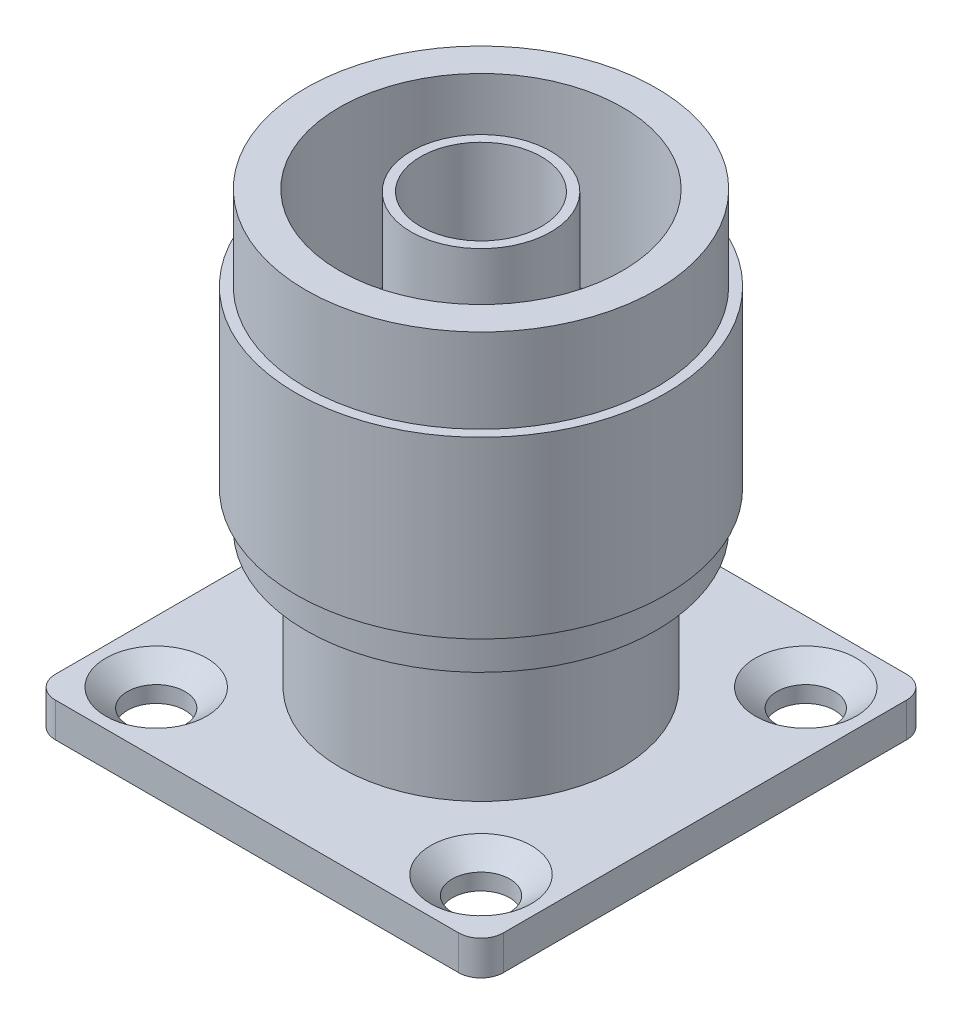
ISO-10303-21;
HEADER;
FILE_DESCRIPTION(('STEP AP214'),'2;1');
FILE_NAME('part.step','',(''),(''),'','','');
FILE_SCHEMA(('AUTOMOTIVE_DESIGN { 1 0 10303 214 1 1 1 1 }'));
ENDSEC;
DATA;
#1=APPLICATION_CONTEXT('core data for automotive mechanical design processes');
#2=APPLICATION_PROTOCOL_DEFINITION('international standard','automotive_design',2000,#1);
#3=PRODUCT_CONTEXT('',#1,'mechanical');
#4=PRODUCT('Part','Part','',(#3));
#5=PRODUCT_RELATED_PRODUCT_CATEGORY('part','',(#4));
#6=PRODUCT_DEFINITION_FORMATION('','',#4);
#7=PRODUCT_DEFINITION_CONTEXT('part definition',#1,'design');
#8=PRODUCT_DEFINITION('design','',#6,#7);
#9=PRODUCT_DEFINITION_SHAPE('','',#8);
#10=(LENGTH_UNIT() NAMED_UNIT(*) SI_UNIT(.MILLI.,.METRE.));
#11=(NAMED_UNIT(*) PLANE_ANGLE_UNIT() SI_UNIT($,.RADIAN.));
#12=(NAMED_UNIT(*) SI_UNIT($,.STERADIAN.) SOLID_ANGLE_UNIT());
#13=UNCERTAINTY_MEASURE_WITH_UNIT(LENGTH_MEASURE(1.E-05),#10,'distance_accuracy_value','');
#14=(GEOMETRIC_REPRESENTATION_CONTEXT(3) GLOBAL_UNCERTAINTY_ASSIGNED_CONTEXT((#13)) GLOBAL_UNIT_ASSIGNED_CONTEXT((#10,
#11,#12)) REPRESENTATION_CONTEXT('',''));
#15=CARTESIAN_POINT('',(0.,0.,0.));
#16=DIRECTION('',(0.,0.,1.));
#17=DIRECTION('',(1.,0.,0.));
#18=AXIS2_PLACEMENT_3D('',#15,#16,#17);
#19=CARTESIAN_POINT('',(12.7,1.9558,-12.7));
#20=DIRECTION('',(-1.,0.,0.));
#21=DIRECTION('',(0.,0.,1.));
#22=AXIS2_PLACEMENT_3D('',#19,#20,#21);
#23=PLANE('',#22);
#24=DIRECTION('',(0.,0.,-1.));
#25=VECTOR('',#24,1.);
#26=CARTESIAN_POINT('',(12.7,1.9558,-12.7));
#27=LINE('',#26,#25);
#28=CARTESIAN_POINT('',(12.7,1.9558,11.43));
#29=VERTEX_POINT('',#28);
#30=CARTESIAN_POINT('',(12.7,1.9558,-11.43));
#31=VERTEX_POINT('',#30);
#32=EDGE_CURVE('E122',#29,#31,#27,.T.);
#33=ORIENTED_EDGE('',*,*,#32,.F.);
#34=DIRECTION('',(0.,-1.,0.));
#35=VECTOR('',#34,1.);
#36=CARTESIAN_POINT('',(12.7,1.9558,11.43));
#37=LINE('',#36,#35);
#38=CARTESIAN_POINT('',(12.7,0.,11.43));
#39=VERTEX_POINT('',#38);
#40=EDGE_CURVE('E107',#29,#39,#37,.T.);
#41=ORIENTED_EDGE('',*,*,#40,.T.);
#42=DIRECTION('',(0.,0.,-1.));
#43=VECTOR('',#42,1.);
#44=CARTESIAN_POINT('',(12.7,0.,-12.7));
#45=LINE('',#44,#43);
#46=CARTESIAN_POINT('',(12.7,0.,-11.43));
#47=VERTEX_POINT('',#46);
#48=EDGE_CURVE('E119',#39,#47,#45,.T.);
#49=ORIENTED_EDGE('',*,*,#48,.T.);
#50=DIRECTION('',(0.,-1.,0.));
#51=VECTOR('',#50,1.);
#52=CARTESIAN_POINT('',(12.7,1.9558,-11.43));
#53=LINE('',#52,#51);
#54=EDGE_CURVE('E124',#47,#31,#53,.F.);
#55=ORIENTED_EDGE('',*,*,#54,.T.);
#56=EDGE_LOOP('',(#33,#41,#49,#55));
#57=FACE_BOUND('',#56,.T.);
#58=ADVANCED_FACE('F34',(#57),#23,.F.);
#59=CARTESIAN_POINT('',(-12.7,1.9558,-12.7));
#60=DIRECTION('',(0.,0.,1.));
#61=DIRECTION('',(1.,0.,0.));
#62=AXIS2_PLACEMENT_3D('',#59,#60,#61);
#63=PLANE('',#62);
#64=DIRECTION('',(-1.,0.,0.));
#65=VECTOR('',#64,1.);
#66=CARTESIAN_POINT('',(-12.7,1.9558,-12.7));
#67=LINE('',#66,#65);
#68=CARTESIAN_POINT('',(11.43,1.9558,-12.7));
#69=VERTEX_POINT('',#68);
#70=CARTESIAN_POINT('',(-11.43,1.9558,-12.7));
#71=VERTEX_POINT('',#70);
#72=EDGE_CURVE('E252',#69,#71,#67,.T.);
#73=ORIENTED_EDGE('',*,*,#72,.F.);
#74=DIRECTION('',(0.,-1.,0.));
#75=VECTOR('',#74,1.);
#76=CARTESIAN_POINT('',(11.43,1.9558,-12.7));
#77=LINE('',#76,#75);
#78=CARTESIAN_POINT('',(11.43,0.,-12.7));
#79=VERTEX_POINT('',#78);
#80=EDGE_CURVE('E43',#69,#79,#77,.T.);
#81=ORIENTED_EDGE('',*,*,#80,.T.);
#82=DIRECTION('',(-1.,0.,0.));
#83=VECTOR('',#82,1.);
#84=CARTESIAN_POINT('',(-12.7,0.,-12.7));
#85=LINE('',#84,#83);
#86=CARTESIAN_POINT('',(-11.43,0.,-12.7));
#87=VERTEX_POINT('',#86);
#88=EDGE_CURVE('E129',#79,#87,#85,.T.);
#89=ORIENTED_EDGE('',*,*,#88,.T.);
#90=DIRECTION('',(0.,-1.,0.));
#91=VECTOR('',#90,1.);
#92=CARTESIAN_POINT('',(-11.43,1.9558,-12.7));
#93=LINE('',#92,#91);
#94=EDGE_CURVE('E163',#87,#71,#93,.F.);
#95=ORIENTED_EDGE('',*,*,#94,.T.);
#96=EDGE_LOOP('',(#73,#81,#89,#95));
#97=FACE_BOUND('',#96,.T.);
#98=ADVANCED_FACE('F270',(#97),#63,.F.);
#99=CARTESIAN_POINT('',(-12.7,1.9558,-12.7));
#100=DIRECTION('',(1.,0.,0.));
#101=DIRECTION('',(0.,0.,-1.));
#102=AXIS2_PLACEMENT_3D('',#99,#100,#101);
#103=PLANE('',#102);
#104=DIRECTION('',(0.,0.,1.));
#105=VECTOR('',#104,1.);
#106=CARTESIAN_POINT('',(-12.7,0.,-12.7));
#107=LINE('',#106,#105);
#108=CARTESIAN_POINT('',(-12.7,0.,-11.43));
#109=VERTEX_POINT('',#108);
#110=CARTESIAN_POINT('',(-12.7,0.,11.43));
#111=VERTEX_POINT('',#110);
#112=EDGE_CURVE('E133',#109,#111,#107,.T.);
#113=ORIENTED_EDGE('',*,*,#112,.T.);
#114=DIRECTION('',(0.,-1.,0.));
#115=VECTOR('',#114,1.);
#116=CARTESIAN_POINT('',(-12.7,1.9558,11.43));
#117=LINE('',#116,#115);
#118=CARTESIAN_POINT('',(-12.7,1.9558,11.43));
#119=VERTEX_POINT('',#118);
#120=EDGE_CURVE('E51',#111,#119,#117,.F.);
#121=ORIENTED_EDGE('',*,*,#120,.T.);
#122=DIRECTION('',(0.,0.,1.));
#123=VECTOR('',#122,1.);
#124=CARTESIAN_POINT('',(-12.7,1.9558,-12.7));
#125=LINE('',#124,#123);
#126=CARTESIAN_POINT('',(-12.7,1.9558,-11.43));
#127=VERTEX_POINT('',#126);
#128=EDGE_CURVE('E253',#127,#119,#125,.T.);
#129=ORIENTED_EDGE('',*,*,#128,.F.);
#130=DIRECTION('',(0.,-1.,0.));
#131=VECTOR('',#130,1.);
#132=CARTESIAN_POINT('',(-12.7,1.9558,-11.43));
#133=LINE('',#132,#131);
#134=EDGE_CURVE('E159',#127,#109,#133,.T.);
#135=ORIENTED_EDGE('',*,*,#134,.T.);
#136=EDGE_LOOP('',(#113,#121,#129,#135));
#137=FACE_BOUND('',#136,.T.);
#138=ADVANCED_FACE('F264',(#137),#103,.F.);
#139=CARTESIAN_POINT('',(-12.7,1.9558,12.7));
#140=DIRECTION('',(0.,0.,-1.));
#141=DIRECTION('',(-1.,0.,0.));
#142=AXIS2_PLACEMENT_3D('',#139,#140,#141);
#143=PLANE('',#142);
#144=DIRECTION('',(1.,0.,0.));
#145=VECTOR('',#144,1.);
#146=CARTESIAN_POINT('',(-12.7,0.,12.7));
#147=LINE('',#146,#145);
#148=CARTESIAN_POINT('',(-11.43,0.,12.7));
#149=VERTEX_POINT('',#148);
#150=CARTESIAN_POINT('',(11.43,0.,12.7));
#151=VERTEX_POINT('',#150);
#152=EDGE_CURVE('E143',#149,#151,#147,.T.);
#153=ORIENTED_EDGE('',*,*,#152,.T.);
#154=DIRECTION('',(0.,-1.,0.));
#155=VECTOR('',#154,1.);
#156=CARTESIAN_POINT('',(11.43,1.9558,12.7));
#157=LINE('',#156,#155);
#158=CARTESIAN_POINT('',(11.43,1.9558,12.7));
#159=VERTEX_POINT('',#158);
#160=EDGE_CURVE('E108',#151,#159,#157,.F.);
#161=ORIENTED_EDGE('',*,*,#160,.T.);
#162=DIRECTION('',(1.,0.,0.));
#163=VECTOR('',#162,1.);
#164=CARTESIAN_POINT('',(-12.7,1.9558,12.7));
#165=LINE('',#164,#163);
#166=CARTESIAN_POINT('',(-11.43,1.9558,12.7));
#167=VERTEX_POINT('',#166);
#168=EDGE_CURVE('E139',#167,#159,#165,.T.);
#169=ORIENTED_EDGE('',*,*,#168,.F.);
#170=DIRECTION('',(0.,-1.,0.));
#171=VECTOR('',#170,1.);
#172=CARTESIAN_POINT('',(-11.43,1.9558,12.7));
#173=LINE('',#172,#171);
#174=EDGE_CURVE('E113',#167,#149,#173,.T.);
#175=ORIENTED_EDGE('',*,*,#174,.T.);
#176=EDGE_LOOP('',(#153,#161,#169,#175));
#177=FACE_BOUND('',#176,.T.);
#178=ADVANCED_FACE('F260',(#177),#143,.F.);
#179=CARTESIAN_POINT('',(0.,1.9558,0.));
#180=DIRECTION('',(0.,1.,0.));
#181=DIRECTION('',(0.,0.,1.));
#182=AXIS2_PLACEMENT_3D('',#179,#180,#181);
#183=PLANE('',#182);
#184=CARTESIAN_POINT('',(-9.2075,1.9558,-9.2075));
#185=DIRECTION('',(0.,1.,0.));
#186=DIRECTION('',(0.,0.,1.));
#187=AXIS2_PLACEMENT_3D('',#184,#185,#186);
#188=CIRCLE('',#187,2.8575);
#189=CARTESIAN_POINT('',(-9.2075,1.9558,-6.35));
#190=VERTEX_POINT('',#189);
#191=EDGE_CURVE('E660',#190,#190,#188,.T.);
#192=ORIENTED_EDGE('',*,*,#191,.F.);
#193=EDGE_LOOP('',(#192));
#194=FACE_BOUND('',#193,.T.);
#195=CARTESIAN_POINT('',(9.2075,1.9558,-9.2075));
#196=DIRECTION('',(0.,1.,0.));
#197=DIRECTION('',(0.,0.,1.));
#198=AXIS2_PLACEMENT_3D('',#195,#196,#197);
#199=CIRCLE('',#198,2.8575);
#200=CARTESIAN_POINT('',(9.2075,1.9558,-6.35));
#201=VERTEX_POINT('',#200);
#202=EDGE_CURVE('E185',#201,#201,#199,.T.);
#203=ORIENTED_EDGE('',*,*,#202,.F.);
#204=EDGE_LOOP('',(#203));
#205=FACE_BOUND('',#204,.T.);
#206=CARTESIAN_POINT('',(9.2075,1.9558,9.2075));
#207=DIRECTION('',(0.,1.,0.));
#208=DIRECTION('',(0.,0.,1.));
#209=AXIS2_PLACEMENT_3D('',#206,#207,#208);
#210=CIRCLE('',#209,2.8575);
#211=CARTESIAN_POINT('',(9.2075,1.9558,12.065));
#212=VERTEX_POINT('',#211);
#213=EDGE_CURVE('E178',#212,#212,#210,.T.);
#214=ORIENTED_EDGE('',*,*,#213,.F.);
#215=EDGE_LOOP('',(#214));
#216=FACE_BOUND('',#215,.T.);
#217=CARTESIAN_POINT('',(-9.2075,1.9558,9.2075));
#218=DIRECTION('',(0.,1.,0.));
#219=DIRECTION('',(0.,0.,1.));
#220=AXIS2_PLACEMENT_3D('',#217,#218,#219);
#221=CIRCLE('',#220,2.8575);
#222=CARTESIAN_POINT('',(-9.2075,1.9558,12.065));
#223=VERTEX_POINT('',#222);
#224=EDGE_CURVE('E174',#223,#223,#221,.T.);
#225=ORIENTED_EDGE('',*,*,#224,.F.);
#226=EDGE_LOOP('',(#225));
#227=FACE_BOUND('',#226,.T.);
#228=CARTESIAN_POINT('',(0.,1.9558,0.));
#229=DIRECTION('',(0.,1.,0.));
#230=DIRECTION('',(0.,0.,1.));
#231=AXIS2_PLACEMENT_3D('',#228,#229,#230);
#232=CIRCLE('',#231,7.9375);
#233=CARTESIAN_POINT('',(0.,1.9558,7.9375));
#234=VERTEX_POINT('',#233);
#235=EDGE_CURVE('E136',#234,#234,#232,.T.);
#236=ORIENTED_EDGE('',*,*,#235,.F.);
#237=EDGE_LOOP('',(#236));
#238=FACE_BOUND('',#237,.T.);
#239=ORIENTED_EDGE('',*,*,#168,.T.);
#240=CARTESIAN_POINT('',(11.43,1.9558,11.43));
#241=DIRECTION('',(0.,1.,0.));
#242=DIRECTION('',(0.,0.,1.));
#243=AXIS2_PLACEMENT_3D('',#240,#241,#242);
#244=CIRCLE('',#243,1.27);
#245=EDGE_CURVE('E157',#159,#29,#244,.T.);
#246=ORIENTED_EDGE('',*,*,#245,.T.);
#247=ORIENTED_EDGE('',*,*,#32,.T.);
#248=CARTESIAN_POINT('',(11.43,1.9558,-11.43));
#249=DIRECTION('',(0.,1.,0.));
#250=DIRECTION('',(0.,0.,1.));
#251=AXIS2_PLACEMENT_3D('',#248,#249,#250);
#252=CIRCLE('',#251,1.27);
#253=EDGE_CURVE('E153',#31,#69,#252,.T.);
#254=ORIENTED_EDGE('',*,*,#253,.T.);
#255=ORIENTED_EDGE('',*,*,#72,.T.);
#256=CARTESIAN_POINT('',(-11.43,1.9558,-11.43));
#257=DIRECTION('',(0.,1.,0.));
#258=DIRECTION('',(0.,0.,1.));
#259=AXIS2_PLACEMENT_3D('',#256,#257,#258);
#260=CIRCLE('',#259,1.27);
#261=EDGE_CURVE('E58',#71,#127,#260,.T.);
#262=ORIENTED_EDGE('',*,*,#261,.T.);
#263=ORIENTED_EDGE('',*,*,#128,.T.);
#264=CARTESIAN_POINT('',(-11.43,1.9558,11.43));
#265=DIRECTION('',(0.,1.,0.));
#266=DIRECTION('',(0.,0.,1.));
#267=AXIS2_PLACEMENT_3D('',#264,#265,#266);
#268=CIRCLE('',#267,1.27);
#269=EDGE_CURVE('E155',#119,#167,#268,.T.);
#270=ORIENTED_EDGE('',*,*,#269,.T.);
#271=EDGE_LOOP('',(#239,#246,#247,#254,#255,#262,#263,#270));
#272=FACE_BOUND('',#271,.T.);
#273=ADVANCED_FACE('F257',(#194,#205,#216,#227,#238,#272),#183,.T.);
#274=CARTESIAN_POINT('',(0.,0.,0.));
#275=DIRECTION('',(0.,1.,0.));
#276=DIRECTION('',(0.,0.,1.));
#277=AXIS2_PLACEMENT_3D('',#274,#275,#276);
#278=PLANE('',#277);
#279=CARTESIAN_POINT('',(-9.2075,0.,-9.2075));
#280=DIRECTION('',(0.,1.,0.));
#281=DIRECTION('',(0.,0.,1.));
#282=AXIS2_PLACEMENT_3D('',#279,#280,#281);
#283=CIRCLE('',#282,1.63194999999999);
#284=CARTESIAN_POINT('',(-9.2075,0.,-7.57555));
#285=VERTEX_POINT('',#284);
#286=EDGE_CURVE('E38',#285,#285,#283,.T.);
#287=ORIENTED_EDGE('',*,*,#286,.T.);
#288=EDGE_LOOP('',(#287));
#289=FACE_BOUND('',#288,.T.);
#290=CARTESIAN_POINT('',(9.2075,0.,-9.2075));
#291=DIRECTION('',(0.,1.,0.));
#292=DIRECTION('',(0.,0.,1.));
#293=AXIS2_PLACEMENT_3D('',#290,#291,#292);
#294=CIRCLE('',#293,1.63194999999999);
#295=CARTESIAN_POINT('',(9.2075,0.,-7.57555));
#296=VERTEX_POINT('',#295);
#297=EDGE_CURVE('E176',#296,#296,#294,.T.);
#298=ORIENTED_EDGE('',*,*,#297,.T.);
#299=EDGE_LOOP('',(#298));
#300=FACE_BOUND('',#299,.T.);
#301=CARTESIAN_POINT('',(9.2075,0.,9.2075));
#302=DIRECTION('',(0.,1.,0.));
#303=DIRECTION('',(0.,0.,1.));
#304=AXIS2_PLACEMENT_3D('',#301,#302,#303);
#305=CIRCLE('',#304,1.63194999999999);
#306=CARTESIAN_POINT('',(9.2075,0.,10.83945));
#307=VERTEX_POINT('',#306);
#308=EDGE_CURVE('E172',#307,#307,#305,.T.);
#309=ORIENTED_EDGE('',*,*,#308,.T.);
#310=EDGE_LOOP('',(#309));
#311=FACE_BOUND('',#310,.T.);
#312=CARTESIAN_POINT('',(-9.2075,0.,9.2075));
#313=DIRECTION('',(0.,1.,0.));
#314=DIRECTION('',(0.,0.,1.));
#315=AXIS2_PLACEMENT_3D('',#312,#313,#314);
#316=CIRCLE('',#315,1.63194999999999);
#317=CARTESIAN_POINT('',(-9.2075,0.,10.83945));
#318=VERTEX_POINT('',#317);
#319=EDGE_CURVE('E167',#318,#318,#316,.T.);
#320=ORIENTED_EDGE('',*,*,#319,.T.);
#321=EDGE_LOOP('',(#320));
#322=FACE_BOUND('',#321,.T.);
#323=CARTESIAN_POINT('',(0.,0.,0.));
#324=DIRECTION('',(0.,1.,0.));
#325=DIRECTION('',(0.,0.,1.));
#326=AXIS2_PLACEMENT_3D('',#323,#324,#325);
#327=CIRCLE('',#326,6.0198);
#328=CARTESIAN_POINT('',(0.,0.,6.0198));
#329=VERTEX_POINT('',#328);
#330=EDGE_CURVE('E11',#329,#329,#327,.F.);
#331=ORIENTED_EDGE('',*,*,#330,.F.);
#332=EDGE_LOOP('',(#331));
#333=FACE_BOUND('',#332,.T.);
#334=ORIENTED_EDGE('',*,*,#48,.F.);
#335=CARTESIAN_POINT('',(11.43,0.,11.43));
#336=DIRECTION('',(0.,1.,0.));
#337=DIRECTION('',(0.,0.,1.));
#338=AXIS2_PLACEMENT_3D('',#335,#336,#337);
#339=CIRCLE('',#338,1.27);
#340=EDGE_CURVE('E103',#39,#151,#339,.F.);
#341=ORIENTED_EDGE('',*,*,#340,.T.);
#342=ORIENTED_EDGE('',*,*,#152,.F.);
#343=CARTESIAN_POINT('',(-11.43,0.,11.43));
#344=DIRECTION('',(0.,1.,0.));
#345=DIRECTION('',(0.,0.,1.));
#346=AXIS2_PLACEMENT_3D('',#343,#344,#345);
#347=CIRCLE('',#346,1.27);
#348=EDGE_CURVE('E114',#149,#111,#347,.F.);
#349=ORIENTED_EDGE('',*,*,#348,.T.);
#350=ORIENTED_EDGE('',*,*,#112,.F.);
#351=CARTESIAN_POINT('',(-11.43,0.,-11.43));
#352=DIRECTION('',(0.,1.,0.));
#353=DIRECTION('',(0.,0.,1.));
#354=AXIS2_PLACEMENT_3D('',#351,#352,#353);
#355=CIRCLE('',#354,1.27);
#356=EDGE_CURVE('E123',#109,#87,#355,.F.);
#357=ORIENTED_EDGE('',*,*,#356,.T.);
#358=ORIENTED_EDGE('',*,*,#88,.F.);
#359=CARTESIAN_POINT('',(11.43,0.,-11.43));
#360=DIRECTION('',(0.,1.,0.));
#361=DIRECTION('',(0.,0.,1.));
#362=AXIS2_PLACEMENT_3D('',#359,#360,#361);
#363=CIRCLE('',#362,1.27);
#364=EDGE_CURVE('E128',#79,#47,#363,.F.);
#365=ORIENTED_EDGE('',*,*,#364,.T.);
#366=EDGE_LOOP('',(#334,#341,#342,#349,#350,#357,#358,#365));
#367=FACE_BOUND('',#366,.T.);
#368=ADVANCED_FACE('F126',(#289,#300,#311,#322,#333,#367),#278,.F.);
#369=CARTESIAN_POINT('',(11.43,1.9558,11.43));
#370=DIRECTION('',(0.,-1.,0.));
#371=DIRECTION('',(0.,0.,-1.));
#372=AXIS2_PLACEMENT_3D('',#369,#370,#371);
#373=CYLINDRICAL_SURFACE('',#372,1.27);
#374=ORIENTED_EDGE('',*,*,#245,.F.);
#375=ORIENTED_EDGE('',*,*,#160,.F.);
#376=ORIENTED_EDGE('',*,*,#340,.F.);
#377=ORIENTED_EDGE('',*,*,#40,.F.);
#378=EDGE_LOOP('',(#374,#375,#376,#377));
#379=FACE_BOUND('',#378,.T.);
#380=ADVANCED_FACE('F106',(#379),#373,.T.);
#381=CARTESIAN_POINT('',(-11.43,1.9558,11.43));
#382=DIRECTION('',(0.,-1.,0.));
#383=DIRECTION('',(0.,0.,-1.));
#384=AXIS2_PLACEMENT_3D('',#381,#382,#383);
#385=CYLINDRICAL_SURFACE('',#384,1.27);
#386=ORIENTED_EDGE('',*,*,#269,.F.);
#387=ORIENTED_EDGE('',*,*,#120,.F.);
#388=ORIENTED_EDGE('',*,*,#348,.F.);
#389=ORIENTED_EDGE('',*,*,#174,.F.);
#390=EDGE_LOOP('',(#386,#387,#388,#389));
#391=FACE_BOUND('',#390,.T.);
#392=ADVANCED_FACE('F262',(#391),#385,.T.);
#393=CARTESIAN_POINT('',(11.43,1.9558,-11.43));
#394=DIRECTION('',(0.,-1.,0.));
#395=DIRECTION('',(0.,0.,-1.));
#396=AXIS2_PLACEMENT_3D('',#393,#394,#395);
#397=CYLINDRICAL_SURFACE('',#396,1.27);
#398=ORIENTED_EDGE('',*,*,#253,.F.);
#399=ORIENTED_EDGE('',*,*,#54,.F.);
#400=ORIENTED_EDGE('',*,*,#364,.F.);
#401=ORIENTED_EDGE('',*,*,#80,.F.);
#402=EDGE_LOOP('',(#398,#399,#400,#401));
#403=FACE_BOUND('',#402,.T.);
#404=ADVANCED_FACE('F274',(#403),#397,.T.);
#405=CARTESIAN_POINT('',(-11.43,1.9558,-11.43));
#406=DIRECTION('',(0.,-1.,0.));
#407=DIRECTION('',(0.,0.,-1.));
#408=AXIS2_PLACEMENT_3D('',#405,#406,#407);
#409=CYLINDRICAL_SURFACE('',#408,1.27);
#410=ORIENTED_EDGE('',*,*,#261,.F.);
#411=ORIENTED_EDGE('',*,*,#94,.F.);
#412=ORIENTED_EDGE('',*,*,#356,.F.);
#413=ORIENTED_EDGE('',*,*,#134,.F.);
#414=EDGE_LOOP('',(#410,#411,#412,#413));
#415=FACE_BOUND('',#414,.T.);
#416=ADVANCED_FACE('F36',(#415),#409,.T.);
#417=CARTESIAN_POINT('',(0.,9.7028,0.));
#418=DIRECTION('',(0.,-1.,0.));
#419=DIRECTION('',(0.,0.,-1.));
#420=AXIS2_PLACEMENT_3D('',#417,#418,#419);
#421=CYLINDRICAL_SURFACE('',#420,7.9375);
#422=CARTESIAN_POINT('',(0.,9.7028,0.));
#423=DIRECTION('',(0.,1.,0.));
#424=DIRECTION('',(0.,0.,1.));
#425=AXIS2_PLACEMENT_3D('',#422,#423,#424);
#426=CIRCLE('',#425,7.9375);
#427=CARTESIAN_POINT('',(0.,9.7028,7.9375));
#428=VERTEX_POINT('',#427);
#429=EDGE_CURVE('E130',#428,#428,#426,.T.);
#430=ORIENTED_EDGE('',*,*,#429,.F.);
#431=EDGE_LOOP('',(#430));
#432=FACE_BOUND('',#431,.T.);
#433=ORIENTED_EDGE('',*,*,#235,.T.);
#434=EDGE_LOOP('',(#433));
#435=FACE_BOUND('',#434,.T.);
#436=ADVANCED_FACE('F280',(#432,#435),#421,.T.);
#437=CARTESIAN_POINT('',(0.,11.7348,0.));
#438=DIRECTION('',(0.,-1.,0.));
#439=DIRECTION('',(0.,0.,-1.));
#440=AXIS2_PLACEMENT_3D('',#437,#438,#439);
#441=CYLINDRICAL_SURFACE('',#440,9.9314);
#442=CARTESIAN_POINT('',(0.,11.7348,0.));
#443=DIRECTION('',(0.,1.,0.));
#444=DIRECTION('',(0.,0.,1.));
#445=AXIS2_PLACEMENT_3D('',#442,#443,#444);
#446=CIRCLE('',#445,9.9314);
#447=CARTESIAN_POINT('',(0.,11.7348,9.9314));
#448=VERTEX_POINT('',#447);
#449=EDGE_CURVE('E244',#448,#448,#446,.T.);
#450=ORIENTED_EDGE('',*,*,#449,.F.);
#451=EDGE_LOOP('',(#450));
#452=FACE_BOUND('',#451,.T.);
#453=CARTESIAN_POINT('',(0.,9.7028,0.));
#454=DIRECTION('',(0.,1.,0.));
#455=DIRECTION('',(0.,0.,1.));
#456=AXIS2_PLACEMENT_3D('',#453,#454,#455);
#457=CIRCLE('',#456,9.9314);
#458=CARTESIAN_POINT('',(0.,9.7028,9.9314));
#459=VERTEX_POINT('',#458);
#460=EDGE_CURVE('E241',#459,#459,#457,.T.);
#461=ORIENTED_EDGE('',*,*,#460,.T.);
#462=EDGE_LOOP('',(#461));
#463=FACE_BOUND('',#462,.T.);
#464=ADVANCED_FACE('F480',(#452,#463),#441,.T.);
#465=CARTESIAN_POINT('',(0.,9.7028,0.));
#466=DIRECTION('',(0.,1.,0.));
#467=DIRECTION('',(0.,0.,1.));
#468=AXIS2_PLACEMENT_3D('',#465,#466,#467);
#469=PLANE('',#468);
#470=ORIENTED_EDGE('',*,*,#429,.T.);
#471=EDGE_LOOP('',(#470));
#472=FACE_BOUND('',#471,.T.);
#473=ORIENTED_EDGE('',*,*,#460,.F.);
#474=EDGE_LOOP('',(#473));
#475=FACE_BOUND('',#474,.T.);
#476=ADVANCED_FACE('F476',(#472,#475),#469,.F.);
#477=CARTESIAN_POINT('',(0.,21.6408,0.));
#478=DIRECTION('',(0.,-1.,0.));
#479=DIRECTION('',(0.,0.,-1.));
#480=AXIS2_PLACEMENT_3D('',#477,#478,#479);
#481=CYLINDRICAL_SURFACE('',#480,10.4902);
#482=CARTESIAN_POINT('',(0.,21.6408,0.));
#483=DIRECTION('',(0.,1.,0.));
#484=DIRECTION('',(0.,0.,1.));
#485=AXIS2_PLACEMENT_3D('',#482,#483,#484);
#486=CIRCLE('',#485,10.4902);
#487=CARTESIAN_POINT('',(0.,21.6408,10.4902));
#488=VERTEX_POINT('',#487);
#489=EDGE_CURVE('E238',#488,#488,#486,.T.);
#490=ORIENTED_EDGE('',*,*,#489,.F.);
#491=EDGE_LOOP('',(#490));
#492=FACE_BOUND('',#491,.T.);
#493=CARTESIAN_POINT('',(0.,11.7348,0.));
#494=DIRECTION('',(0.,1.,0.));
#495=DIRECTION('',(0.,0.,1.));
#496=AXIS2_PLACEMENT_3D('',#493,#494,#495);
#497=CIRCLE('',#496,10.4902);
#498=CARTESIAN_POINT('',(0.,11.7348,10.4902));
#499=VERTEX_POINT('',#498);
#500=EDGE_CURVE('E235',#499,#499,#497,.T.);
#501=ORIENTED_EDGE('',*,*,#500,.T.);
#502=EDGE_LOOP('',(#501));
#503=FACE_BOUND('',#502,.T.);
#504=ADVANCED_FACE('F469',(#492,#503),#481,.T.);
#505=CARTESIAN_POINT('',(0.,21.6408,0.));
#506=DIRECTION('',(0.,1.,0.));
#507=DIRECTION('',(0.,0.,1.));
#508=AXIS2_PLACEMENT_3D('',#505,#506,#507);
#509=PLANE('',#508);
#510=CARTESIAN_POINT('',(0.,21.6408,0.));
#511=DIRECTION('',(0.,1.,0.));
#512=DIRECTION('',(0.,0.,1.));
#513=AXIS2_PLACEMENT_3D('',#510,#511,#512);
#514=CIRCLE('',#513,9.9314);
#515=CARTESIAN_POINT('',(0.,21.6408,9.9314));
#516=VERTEX_POINT('',#515);
#517=EDGE_CURVE('E229',#516,#516,#514,.T.);
#518=ORIENTED_EDGE('',*,*,#517,.F.);
#519=EDGE_LOOP('',(#518));
#520=FACE_BOUND('',#519,.T.);
#521=ORIENTED_EDGE('',*,*,#489,.T.);
#522=EDGE_LOOP('',(#521));
#523=FACE_BOUND('',#522,.T.);
#524=ADVANCED_FACE('F466',(#520,#523),#509,.T.);
#525=CARTESIAN_POINT('',(0.,11.7348,0.));
#526=DIRECTION('',(0.,1.,0.));
#527=DIRECTION('',(0.,0.,1.));
#528=AXIS2_PLACEMENT_3D('',#525,#526,#527);
#529=PLANE('',#528);
#530=ORIENTED_EDGE('',*,*,#449,.T.);
#531=EDGE_LOOP('',(#530));
#532=FACE_BOUND('',#531,.T.);
#533=ORIENTED_EDGE('',*,*,#500,.F.);
#534=EDGE_LOOP('',(#533));
#535=FACE_BOUND('',#534,.T.);
#536=ADVANCED_FACE('F464',(#532,#535),#529,.F.);
#537=CARTESIAN_POINT('',(0.,26.416,0.));
#538=DIRECTION('',(0.,-1.,0.));
#539=DIRECTION('',(0.,0.,-1.));
#540=AXIS2_PLACEMENT_3D('',#537,#538,#539);
#541=CYLINDRICAL_SURFACE('',#540,9.9314);
#542=CARTESIAN_POINT('',(0.,26.416,0.));
#543=DIRECTION('',(0.,1.,0.));
#544=DIRECTION('',(0.,0.,1.));
#545=AXIS2_PLACEMENT_3D('',#542,#543,#544);
#546=CIRCLE('',#545,9.9314);
#547=CARTESIAN_POINT('',(0.,26.416,9.9314));
#548=VERTEX_POINT('',#547);
#549=EDGE_CURVE('E232',#548,#548,#546,.T.);
#550=ORIENTED_EDGE('',*,*,#549,.F.);
#551=EDGE_LOOP('',(#550));
#552=FACE_BOUND('',#551,.T.);
#553=ORIENTED_EDGE('',*,*,#517,.T.);
#554=EDGE_LOOP('',(#553));
#555=FACE_BOUND('',#554,.T.);
#556=ADVANCED_FACE('F460',(#552,#555),#541,.T.);
#557=CARTESIAN_POINT('',(0.,26.416,0.));
#558=DIRECTION('',(0.,1.,0.));
#559=DIRECTION('',(0.,0.,1.));
#560=AXIS2_PLACEMENT_3D('',#557,#558,#559);
#561=PLANE('',#560);
#562=CARTESIAN_POINT('',(0.,26.416,0.));
#563=DIRECTION('',(0.,1.,0.));
#564=DIRECTION('',(0.,0.,1.));
#565=AXIS2_PLACEMENT_3D('',#562,#563,#564);
#566=CIRCLE('',#565,8.0264);
#567=CARTESIAN_POINT('',(0.,26.416,8.0264));
#568=VERTEX_POINT('',#567);
#569=EDGE_CURVE('E223',#568,#568,#566,.T.);
#570=ORIENTED_EDGE('',*,*,#569,.F.);
#571=EDGE_LOOP('',(#570));
#572=FACE_BOUND('',#571,.T.);
#573=ORIENTED_EDGE('',*,*,#549,.T.);
#574=EDGE_LOOP('',(#573));
#575=FACE_BOUND('',#574,.T.);
#576=ADVANCED_FACE('F456',(#572,#575),#561,.T.);
#577=CARTESIAN_POINT('',(0.,16.637,0.));
#578=DIRECTION('',(0.,1.,0.));
#579=DIRECTION('',(0.,0.,1.));
#580=AXIS2_PLACEMENT_3D('',#577,#578,#579);
#581=CYLINDRICAL_SURFACE('',#580,8.0264);
#582=CARTESIAN_POINT('',(0.,16.637,0.));
#583=DIRECTION('',(0.,1.,0.));
#584=DIRECTION('',(0.,0.,1.));
#585=AXIS2_PLACEMENT_3D('',#582,#583,#584);
#586=CIRCLE('',#585,8.0264);
#587=CARTESIAN_POINT('',(0.,16.637,8.0264));
#588=VERTEX_POINT('',#587);
#589=EDGE_CURVE('E226',#588,#588,#586,.T.);
#590=ORIENTED_EDGE('',*,*,#589,.F.);
#591=EDGE_LOOP('',(#590));
#592=FACE_BOUND('',#591,.T.);
#593=ORIENTED_EDGE('',*,*,#569,.T.);
#594=EDGE_LOOP('',(#593));
#595=FACE_BOUND('',#594,.T.);
#596=ADVANCED_FACE('F452',(#592,#595),#581,.F.);
#597=CARTESIAN_POINT('',(0.,16.637,0.));
#598=DIRECTION('',(0.,1.,0.));
#599=DIRECTION('',(0.,0.,1.));
#600=AXIS2_PLACEMENT_3D('',#597,#598,#599);
#601=PLANE('',#600);
#602=CARTESIAN_POINT('',(0.,16.637,0.));
#603=DIRECTION('',(0.,1.,0.));
#604=DIRECTION('',(0.,0.,1.));
#605=AXIS2_PLACEMENT_3D('',#602,#603,#604);
#606=CIRCLE('',#605,3.9624);
#607=CARTESIAN_POINT('',(0.,16.637,3.9624));
#608=VERTEX_POINT('',#607);
#609=EDGE_CURVE('E217',#608,#608,#606,.T.);
#610=ORIENTED_EDGE('',*,*,#609,.F.);
#611=EDGE_LOOP('',(#610));
#612=FACE_BOUND('',#611,.T.);
#613=ORIENTED_EDGE('',*,*,#589,.T.);
#614=EDGE_LOOP('',(#613));
#615=FACE_BOUND('',#614,.T.);
#616=ADVANCED_FACE('F448',(#612,#615),#601,.T.);
#617=CARTESIAN_POINT('',(0.,26.289,0.));
#618=DIRECTION('',(0.,-1.,0.));
#619=DIRECTION('',(0.,0.,-1.));
#620=AXIS2_PLACEMENT_3D('',#617,#618,#619);
#621=CYLINDRICAL_SURFACE('',#620,3.9624);
#622=CARTESIAN_POINT('',(0.,26.289,0.));
#623=DIRECTION('',(0.,1.,0.));
#624=DIRECTION('',(0.,0.,1.));
#625=AXIS2_PLACEMENT_3D('',#622,#623,#624);
#626=CIRCLE('',#625,3.9624);
#627=CARTESIAN_POINT('',(0.,26.289,3.9624));
#628=VERTEX_POINT('',#627);
#629=EDGE_CURVE('E220',#628,#628,#626,.T.);
#630=ORIENTED_EDGE('',*,*,#629,.F.);
#631=EDGE_LOOP('',(#630));
#632=FACE_BOUND('',#631,.T.);
#633=ORIENTED_EDGE('',*,*,#609,.T.);
#634=EDGE_LOOP('',(#633));
#635=FACE_BOUND('',#634,.T.);
#636=ADVANCED_FACE('F444',(#632,#635),#621,.T.);
#637=CARTESIAN_POINT('',(0.,26.289,0.));
#638=DIRECTION('',(0.,1.,0.));
#639=DIRECTION('',(0.,0.,1.));
#640=AXIS2_PLACEMENT_3D('',#637,#638,#639);
#641=PLANE('',#640);
#642=CARTESIAN_POINT('',(0.,26.289,0.));
#643=DIRECTION('',(0.,1.,0.));
#644=DIRECTION('',(0.,0.,1.));
#645=AXIS2_PLACEMENT_3D('',#642,#643,#644);
#646=CIRCLE('',#645,3.429);
#647=CARTESIAN_POINT('',(0.,26.289,3.429));
#648=VERTEX_POINT('',#647);
#649=EDGE_CURVE('E213',#648,#648,#646,.T.);
#650=ORIENTED_EDGE('',*,*,#649,.F.);
#651=EDGE_LOOP('',(#650));
#652=FACE_BOUND('',#651,.T.);
#653=ORIENTED_EDGE('',*,*,#629,.T.);
#654=EDGE_LOOP('',(#653));
#655=FACE_BOUND('',#654,.T.);
#656=ADVANCED_FACE('F440',(#652,#655),#641,.T.);
#657=CARTESIAN_POINT('',(0.,16.637,0.));
#658=DIRECTION('',(0.,1.,0.));
#659=DIRECTION('',(0.,0.,1.));
#660=AXIS2_PLACEMENT_3D('',#657,#658,#659);
#661=CYLINDRICAL_SURFACE('',#660,3.429);
#662=CARTESIAN_POINT('',(0.,16.637,0.));
#663=DIRECTION('',(0.,1.,0.));
#664=DIRECTION('',(0.,0.,1.));
#665=AXIS2_PLACEMENT_3D('',#662,#663,#664);
#666=CIRCLE('',#665,3.429);
#667=CARTESIAN_POINT('',(0.,16.637,3.429));
#668=VERTEX_POINT('',#667);
#669=EDGE_CURVE('E214',#668,#668,#666,.T.);
#670=ORIENTED_EDGE('',*,*,#669,.F.);
#671=EDGE_LOOP('',(#670));
#672=FACE_BOUND('',#671,.T.);
#673=ORIENTED_EDGE('',*,*,#649,.T.);
#674=EDGE_LOOP('',(#673));
#675=FACE_BOUND('',#674,.T.);
#676=ADVANCED_FACE('F436',(#672,#675),#661,.F.);
#677=CARTESIAN_POINT('',(0.,16.637,0.));
#678=DIRECTION('',(0.,1.,0.));
#679=DIRECTION('',(0.,0.,1.));
#680=AXIS2_PLACEMENT_3D('',#677,#678,#679);
#681=PLANE('',#680);
#682=CARTESIAN_POINT('',(0.,16.637,0.));
#683=DIRECTION('',(0.,1.,0.));
#684=DIRECTION('',(0.,0.,1.));
#685=AXIS2_PLACEMENT_3D('',#682,#683,#684);
#686=CIRCLE('',#685,1.651);
#687=CARTESIAN_POINT('',(0.,16.637,1.651));
#688=VERTEX_POINT('',#687);
#689=EDGE_CURVE('E201',#688,#688,#686,.T.);
#690=ORIENTED_EDGE('',*,*,#689,.F.);
#691=EDGE_LOOP('',(#690));
#692=FACE_BOUND('',#691,.T.);
#693=ORIENTED_EDGE('',*,*,#669,.T.);
#694=EDGE_LOOP('',(#693));
#695=FACE_BOUND('',#694,.T.);
#696=ADVANCED_FACE('F432',(#692,#695),#681,.T.);
#697=CARTESIAN_POINT('',(0.,-0.254,0.));
#698=DIRECTION('',(0.,1.,0.));
#699=DIRECTION('',(0.,0.,1.));
#700=AXIS2_PLACEMENT_3D('',#697,#698,#699);
#701=CYLINDRICAL_SURFACE('',#700,6.0198);
#702=CARTESIAN_POINT('',(0.,-0.254,0.));
#703=DIRECTION('',(0.,-1.,0.));
#704=DIRECTION('',(0.,0.,-1.));
#705=AXIS2_PLACEMENT_3D('',#702,#703,#704);
#706=CIRCLE('',#705,6.0198);
#707=CARTESIAN_POINT('',(0.,-0.254,-6.0198));
#708=VERTEX_POINT('',#707);
#709=EDGE_CURVE('E208',#708,#708,#706,.T.);
#710=ORIENTED_EDGE('',*,*,#709,.F.);
#711=EDGE_LOOP('',(#710));
#712=FACE_BOUND('',#711,.T.);
#713=ORIENTED_EDGE('',*,*,#330,.T.);
#714=EDGE_LOOP('',(#713));
#715=FACE_BOUND('',#714,.T.);
#716=ADVANCED_FACE('F428',(#712,#715),#701,.T.);
#717=CARTESIAN_POINT('',(0.,-0.254,0.));
#718=DIRECTION('',(0.,-1.,0.));
#719=DIRECTION('',(0.,0.,-1.));
#720=AXIS2_PLACEMENT_3D('',#717,#718,#719);
#721=PLANE('',#720);
#722=CARTESIAN_POINT('',(0.,-0.254,0.));
#723=DIRECTION('',(0.,-1.,0.));
#724=DIRECTION('',(0.,0.,-1.));
#725=AXIS2_PLACEMENT_3D('',#722,#723,#724);
#726=CIRCLE('',#725,5.08);
#727=CARTESIAN_POINT('',(0.,-0.254,-5.08));
#728=VERTEX_POINT('',#727);
#729=EDGE_CURVE('E204',#728,#728,#726,.T.);
#730=ORIENTED_EDGE('',*,*,#729,.F.);
#731=EDGE_LOOP('',(#730));
#732=FACE_BOUND('',#731,.T.);
#733=ORIENTED_EDGE('',*,*,#709,.T.);
#734=EDGE_LOOP('',(#733));
#735=FACE_BOUND('',#734,.T.);
#736=ADVANCED_FACE('F424',(#732,#735),#721,.T.);
#737=CARTESIAN_POINT('',(0.,0.,0.));
#738=DIRECTION('',(0.,-1.,0.));
#739=DIRECTION('',(0.,0.,-1.));
#740=AXIS2_PLACEMENT_3D('',#737,#738,#739);
#741=CYLINDRICAL_SURFACE('',#740,5.08);
#742=CARTESIAN_POINT('',(0.,0.,0.));
#743=DIRECTION('',(0.,-1.,0.));
#744=DIRECTION('',(0.,0.,-1.));
#745=AXIS2_PLACEMENT_3D('',#742,#743,#744);
#746=CIRCLE('',#745,5.08);
#747=CARTESIAN_POINT('',(0.,0.,-5.08));
#748=VERTEX_POINT('',#747);
#749=EDGE_CURVE('E205',#748,#748,#746,.T.);
#750=ORIENTED_EDGE('',*,*,#749,.F.);
#751=EDGE_LOOP('',(#750));
#752=FACE_BOUND('',#751,.T.);
#753=ORIENTED_EDGE('',*,*,#729,.T.);
#754=EDGE_LOOP('',(#753));
#755=FACE_BOUND('',#754,.T.);
#756=ADVANCED_FACE('F420',(#752,#755),#741,.F.);
#757=CARTESIAN_POINT('',(0.,0.,0.));
#758=DIRECTION('',(0.,-1.,0.));
#759=DIRECTION('',(0.,0.,-1.));
#760=AXIS2_PLACEMENT_3D('',#757,#758,#759);
#761=PLANE('',#760);
#762=CARTESIAN_POINT('',(0.,0.,0.));
#763=DIRECTION('',(0.,-1.,0.));
#764=DIRECTION('',(0.,0.,-1.));
#765=AXIS2_PLACEMENT_3D('',#762,#763,#764);
#766=CIRCLE('',#765,1.651);
#767=CARTESIAN_POINT('',(0.,0.,-1.651));
#768=VERTEX_POINT('',#767);
#769=EDGE_CURVE('E170',#768,#768,#766,.T.);
#770=ORIENTED_EDGE('',*,*,#769,.F.);
#771=EDGE_LOOP('',(#770));
#772=FACE_BOUND('',#771,.T.);
#773=ORIENTED_EDGE('',*,*,#749,.T.);
#774=EDGE_LOOP('',(#773));
#775=FACE_BOUND('',#774,.T.);
#776=ADVANCED_FACE('F416',(#772,#775),#761,.T.);
#777=CARTESIAN_POINT('',(0.,26.416,0.));
#778=DIRECTION('',(0.,-1.,0.));
#779=DIRECTION('',(0.,0.,-1.));
#780=AXIS2_PLACEMENT_3D('',#777,#778,#779);
#781=CYLINDRICAL_SURFACE('',#780,1.651);
#782=ORIENTED_EDGE('',*,*,#689,.T.);
#783=EDGE_LOOP('',(#782));
#784=FACE_BOUND('',#783,.T.);
#785=ORIENTED_EDGE('',*,*,#769,.T.);
#786=EDGE_LOOP('',(#785));
#787=FACE_BOUND('',#786,.T.);
#788=ADVANCED_FACE('F324',(#784,#787),#781,.F.);
#789=CARTESIAN_POINT('',(-9.2075,1.9558,9.2075));
#790=DIRECTION('',(0.,1.,0.));
#791=DIRECTION('',(0.,0.,1.));
#792=AXIS2_PLACEMENT_3D('',#789,#790,#791);
#793=CYLINDRICAL_SURFACE('',#792,1.63194999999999);
#794=CARTESIAN_POINT('',(-9.2075,0.927441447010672,9.2075));
#795=DIRECTION('',(0.,1.,0.));
#796=DIRECTION('',(0.,0.,1.));
#797=AXIS2_PLACEMENT_3D('',#794,#795,#796);
#798=CIRCLE('',#797,1.63194999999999);
#799=CARTESIAN_POINT('',(-9.2075,0.927441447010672,10.83945));
#800=VERTEX_POINT('',#799);
#801=EDGE_CURVE('E171',#800,#800,#798,.T.);
#802=ORIENTED_EDGE('',*,*,#801,.T.);
#803=EDGE_LOOP('',(#802));
#804=FACE_BOUND('',#803,.T.);
#805=ORIENTED_EDGE('',*,*,#319,.F.);
#806=EDGE_LOOP('',(#805));
#807=FACE_BOUND('',#806,.T.);
#808=ADVANCED_FACE('F334',(#804,#807),#793,.F.);
#809=CARTESIAN_POINT('',(-9.2075,1.9558,9.2075));
#810=DIRECTION('',(0.,1.,0.));
#811=DIRECTION('',(0.,0.,1.));
#812=AXIS2_PLACEMENT_3D('',#809,#810,#811);
#813=CONICAL_SURFACE('',#812,2.8575,0.872664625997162);
#814=ORIENTED_EDGE('',*,*,#801,.F.);
#815=EDGE_LOOP('',(#814));
#816=FACE_BOUND('',#815,.T.);
#817=ORIENTED_EDGE('',*,*,#224,.T.);
#818=EDGE_LOOP('',(#817));
#819=FACE_BOUND('',#818,.T.);
#820=ADVANCED_FACE('F339',(#816,#819),#813,.F.);
#821=CARTESIAN_POINT('',(9.2075,1.9558,9.2075));
#822=DIRECTION('',(0.,1.,0.));
#823=DIRECTION('',(0.,0.,1.));
#824=AXIS2_PLACEMENT_3D('',#821,#822,#823);
#825=CYLINDRICAL_SURFACE('',#824,1.63194999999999);
#826=CARTESIAN_POINT('',(9.2075,0.927441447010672,9.2075));
#827=DIRECTION('',(0.,1.,0.));
#828=DIRECTION('',(0.,0.,1.));
#829=AXIS2_PLACEMENT_3D('',#826,#827,#828);
#830=CIRCLE('',#829,1.63194999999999);
#831=CARTESIAN_POINT('',(9.2075,0.927441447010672,10.83945));
#832=VERTEX_POINT('',#831);
#833=EDGE_CURVE('E175',#832,#832,#830,.T.);
#834=ORIENTED_EDGE('',*,*,#833,.T.);
#835=EDGE_LOOP('',(#834));
#836=FACE_BOUND('',#835,.T.);
#837=ORIENTED_EDGE('',*,*,#308,.F.);
#838=EDGE_LOOP('',(#837));
#839=FACE_BOUND('',#838,.T.);
#840=ADVANCED_FACE('F349',(#836,#839),#825,.F.);
#841=CARTESIAN_POINT('',(9.2075,1.9558,9.2075));
#842=DIRECTION('',(0.,1.,0.));
#843=DIRECTION('',(0.,0.,1.));
#844=AXIS2_PLACEMENT_3D('',#841,#842,#843);
#845=CONICAL_SURFACE('',#844,2.8575,0.872664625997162);
#846=ORIENTED_EDGE('',*,*,#833,.F.);
#847=EDGE_LOOP('',(#846));
#848=FACE_BOUND('',#847,.T.);
#849=ORIENTED_EDGE('',*,*,#213,.T.);
#850=EDGE_LOOP('',(#849));
#851=FACE_BOUND('',#850,.T.);
#852=ADVANCED_FACE('F359',(#848,#851),#845,.F.);
#853=CARTESIAN_POINT('',(9.2075,1.9558,-9.2075));
#854=DIRECTION('',(0.,1.,0.));
#855=DIRECTION('',(0.,0.,1.));
#856=AXIS2_PLACEMENT_3D('',#853,#854,#855);
#857=CYLINDRICAL_SURFACE('',#856,1.63194999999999);
#858=CARTESIAN_POINT('',(9.2075,0.927441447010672,-9.2075));
#859=DIRECTION('',(0.,1.,0.));
#860=DIRECTION('',(0.,0.,1.));
#861=AXIS2_PLACEMENT_3D('',#858,#859,#860);
#862=CIRCLE('',#861,1.63194999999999);
#863=CARTESIAN_POINT('',(9.2075,0.927441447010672,-7.57555000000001));
#864=VERTEX_POINT('',#863);
#865=EDGE_CURVE('E179',#864,#864,#862,.T.);
#866=ORIENTED_EDGE('',*,*,#865,.T.);
#867=EDGE_LOOP('',(#866));
#868=FACE_BOUND('',#867,.T.);
#869=ORIENTED_EDGE('',*,*,#297,.F.);
#870=EDGE_LOOP('',(#869));
#871=FACE_BOUND('',#870,.T.);
#872=ADVANCED_FACE('F369',(#868,#871),#857,.F.);
#873=CARTESIAN_POINT('',(9.2075,1.9558,-9.2075));
#874=DIRECTION('',(0.,1.,0.));
#875=DIRECTION('',(0.,0.,1.));
#876=AXIS2_PLACEMENT_3D('',#873,#874,#875);
#877=CONICAL_SURFACE('',#876,2.8575,0.872664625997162);
#878=ORIENTED_EDGE('',*,*,#865,.F.);
#879=EDGE_LOOP('',(#878));
#880=FACE_BOUND('',#879,.T.);
#881=ORIENTED_EDGE('',*,*,#202,.T.);
#882=EDGE_LOOP('',(#881));
#883=FACE_BOUND('',#882,.T.);
#884=ADVANCED_FACE('F379',(#880,#883),#877,.F.);
#885=CARTESIAN_POINT('',(-9.2075,1.9558,-9.2075));
#886=DIRECTION('',(0.,1.,0.));
#887=DIRECTION('',(0.,0.,1.));
#888=AXIS2_PLACEMENT_3D('',#885,#886,#887);
#889=CYLINDRICAL_SURFACE('',#888,1.63194999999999);
#890=CARTESIAN_POINT('',(-9.2075,0.927441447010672,-9.2075));
#891=DIRECTION('',(0.,1.,0.));
#892=DIRECTION('',(0.,0.,1.));
#893=AXIS2_PLACEMENT_3D('',#890,#891,#892);
#894=CIRCLE('',#893,1.63194999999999);
#895=CARTESIAN_POINT('',(-9.2075,0.927441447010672,-7.57555000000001));
#896=VERTEX_POINT('',#895);
#897=EDGE_CURVE('E657',#896,#896,#894,.T.);
#898=ORIENTED_EDGE('',*,*,#897,.T.);
#899=EDGE_LOOP('',(#898));
#900=FACE_BOUND('',#899,.T.);
#901=ORIENTED_EDGE('',*,*,#286,.F.);
#902=EDGE_LOOP('',(#901));
#903=FACE_BOUND('',#902,.T.);
#904=ADVANCED_FACE('F388',(#900,#903),#889,.F.);
#905=CARTESIAN_POINT('',(-9.2075,1.9558,-9.2075));
#906=DIRECTION('',(0.,1.,0.));
#907=DIRECTION('',(0.,0.,1.));
#908=AXIS2_PLACEMENT_3D('',#905,#906,#907);
#909=CONICAL_SURFACE('',#908,2.8575,0.872664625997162);
#910=ORIENTED_EDGE('',*,*,#897,.F.);
#911=EDGE_LOOP('',(#910));
#912=FACE_BOUND('',#911,.T.);
#913=ORIENTED_EDGE('',*,*,#191,.T.);
#914=EDGE_LOOP('',(#913));
#915=FACE_BOUND('',#914,.T.);
#916=ADVANCED_FACE('F398',(#912,#915),#909,.F.);
#917=CLOSED_SHELL('',(#58,#98,#138,#178,#273,#368,#380,#392,#404,#416,#436,#464,#476,#504,#524,
#536,#556,#576,#596,#616,#636,#656,#676,#696,#716,#736,#756,#776,#788,#808,#820,#840,#852,#872,
#884,#904,#916));
#918=MANIFOLD_SOLID_BREP('B2',#917);
#919=ADVANCED_BREP_SHAPE_REPRESENTATION('',(#18,#918),#14);
#920=SHAPE_DEFINITION_REPRESENTATION(#9,#919);
ENDSEC;
END-ISO-10303-21;
